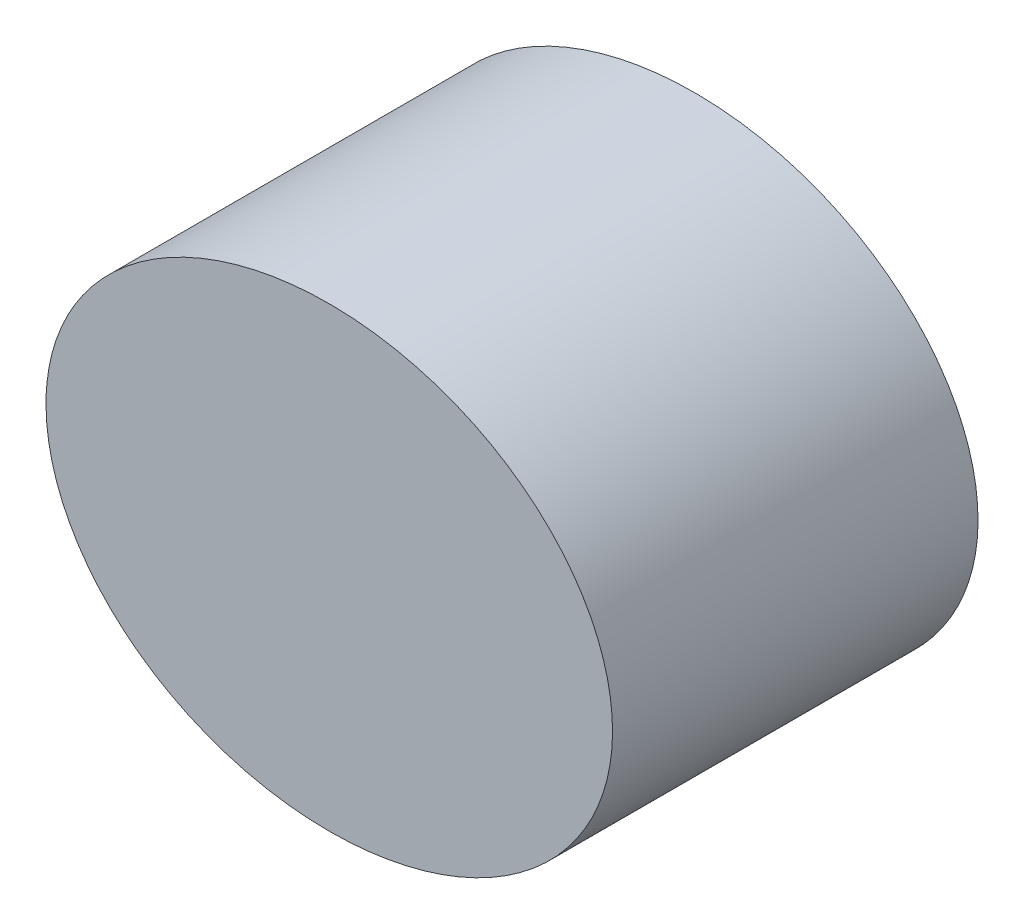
from build123d import *

# Parameters (mm, degrees)
SKETCH1_RX          = 15.5
SKETCH1_RY          = 12.5
BOSS_EXTRUDE1_DEPTH = 20


with BuildPart() as part:
    # Sketch1 → Boss-Extrude1 (new body)
    with BuildSketch(Plane.XY):
        with Locations(Location((0, 0), (0, 0, 180))):
            Ellipse(SKETCH1_RX, SKETCH1_RY)
    extrude(amount=BOSS_EXTRUDE1_DEPTH)


solid = part.part
